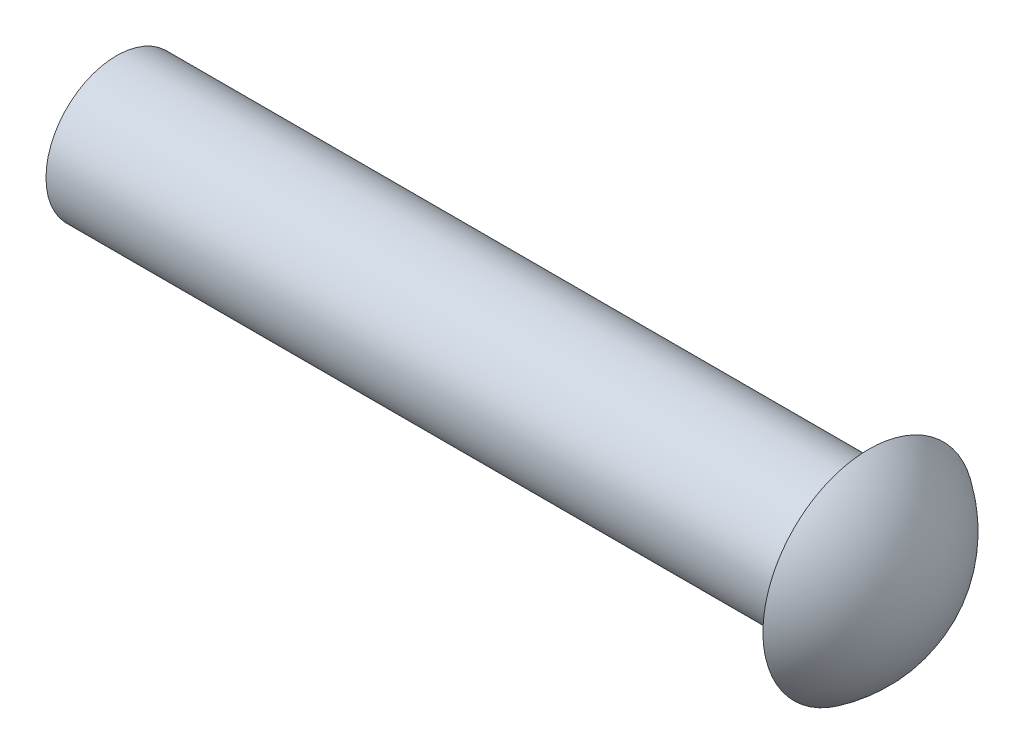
ISO-10303-21;
HEADER;
FILE_DESCRIPTION(('STEP AP214'),'2;1');
FILE_NAME('part.step','',(''),(''),'','','');
FILE_SCHEMA(('AUTOMOTIVE_DESIGN { 1 0 10303 214 1 1 1 1 }'));
ENDSEC;
DATA;
#1=APPLICATION_CONTEXT('core data for automotive mechanical design processes');
#2=APPLICATION_PROTOCOL_DEFINITION('international standard','automotive_design',2000,#1);
#3=PRODUCT_CONTEXT('',#1,'mechanical');
#4=PRODUCT('Part','Part','',(#3));
#5=PRODUCT_RELATED_PRODUCT_CATEGORY('part','',(#4));
#6=PRODUCT_DEFINITION_FORMATION('','',#4);
#7=PRODUCT_DEFINITION_CONTEXT('part definition',#1,'design');
#8=PRODUCT_DEFINITION('design','',#6,#7);
#9=PRODUCT_DEFINITION_SHAPE('','',#8);
#10=(LENGTH_UNIT() NAMED_UNIT(*) SI_UNIT(.MILLI.,.METRE.));
#11=(NAMED_UNIT(*) PLANE_ANGLE_UNIT() SI_UNIT($,.RADIAN.));
#12=(NAMED_UNIT(*) SI_UNIT($,.STERADIAN.) SOLID_ANGLE_UNIT());
#13=UNCERTAINTY_MEASURE_WITH_UNIT(LENGTH_MEASURE(1.E-05),#10,'distance_accuracy_value','');
#14=(GEOMETRIC_REPRESENTATION_CONTEXT(3) GLOBAL_UNCERTAINTY_ASSIGNED_CONTEXT((#13)) GLOBAL_UNIT_ASSIGNED_CONTEXT((#10,
#11,#12)) REPRESENTATION_CONTEXT('',''));
#15=CARTESIAN_POINT('',(0.,0.,0.));
#16=DIRECTION('',(0.,0.,1.));
#17=DIRECTION('',(1.,0.,0.));
#18=AXIS2_PLACEMENT_3D('',#15,#16,#17);
#19=CARTESIAN_POINT('',(0.254,47.752,8.255));
#20=DIRECTION('',(0.744074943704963,0.581212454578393,0.32946101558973));
#21=DIRECTION('',(-0.636418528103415,0.766665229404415,0.0848285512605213));
#22=AXIS2_PLACEMENT_3D('',#19,#20,#21);
#23=SPHERICAL_SURFACE('',#22,2.1336);
#24=CARTESIAN_POINT('',(1.84155829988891,48.9920748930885,8.95793802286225));
#25=VERTEX_POINT('',#24);
#26=VERTEX_LOOP('',#25);
#27=FACE_BOUND('',#26,.T.);
#28=CARTESIAN_POINT('',(1.4224,47.752,10.0402423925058));
#29=CARTESIAN_POINT('',(1.4224,47.6517221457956,10.0402379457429));
#30=CARTESIAN_POINT('',(1.4224,47.5513715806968,10.0317650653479));
#31=CARTESIAN_POINT('',(1.4224,47.3534341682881,9.99808264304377));
#32=CARTESIAN_POINT('',(1.4224,47.2558507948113,9.97285295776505));
#33=CARTESIAN_POINT('',(1.4224,47.0663440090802,9.90637515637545));
#34=CARTESIAN_POINT('',(1.4224,46.974417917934,9.86513469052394));
#35=CARTESIAN_POINT('',(1.4224,46.7988199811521,9.76781650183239));
#36=CARTESIAN_POINT('',(1.4224,46.7151460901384,9.71174246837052));
#37=CARTESIAN_POINT('',(1.4224,46.5583895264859,9.58633755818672));
#38=CARTESIAN_POINT('',(1.4224,46.4853079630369,9.51700529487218));
#39=CARTESIAN_POINT('',(1.4224,46.3518193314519,9.36705274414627));
#40=CARTESIAN_POINT('',(1.4224,46.2914127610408,9.28643201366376));
#41=CARTESIAN_POINT('',(1.4224,46.1849933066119,9.11619488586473));
#42=CARTESIAN_POINT('',(1.4224,46.1389801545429,9.02657865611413));
#43=CARTESIAN_POINT('',(1.4224,46.0626523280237,8.84089339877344));
#44=CARTESIAN_POINT('',(1.4224,46.0323376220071,8.74482438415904));
#45=CARTESIAN_POINT('',(1.4224,45.9882670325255,8.54896032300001));
#46=CARTESIAN_POINT('',(1.4224,45.9745111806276,8.44916526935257));
#47=CARTESIAN_POINT('',(1.4224,45.9639489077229,8.24868237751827));
#48=CARTESIAN_POINT('',(1.4224,45.9671424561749,8.14799454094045));
#49=CARTESIAN_POINT('',(1.4224,45.990388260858,7.9485840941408));
#50=CARTESIAN_POINT('',(1.4224,46.0104405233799,7.84986148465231));
#51=CARTESIAN_POINT('',(1.4224,46.0668345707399,7.65718387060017));
#52=CARTESIAN_POINT('',(1.42239999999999,46.1031763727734,7.56322887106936));
#53=CARTESIAN_POINT('',(1.42239999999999,46.1911178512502,7.38275372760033));
#54=CARTESIAN_POINT('',(1.4224,46.2427175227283,7.29623358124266));
#55=CARTESIAN_POINT('',(1.4224,46.3597099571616,7.13308419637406));
#56=CARTESIAN_POINT('',(1.42240000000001,46.4251027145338,7.05645495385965));
#57=CARTESIAN_POINT('',(1.4224,46.5678250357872,6.9152626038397));
#58=CARTESIAN_POINT('',(1.4224,46.6451546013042,6.85069949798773));
#59=CARTESIAN_POINT('',(1.4224,46.8095553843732,6.73547218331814));
#60=CARTESIAN_POINT('',(1.4224,46.8966266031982,6.68480797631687));
#61=CARTESIAN_POINT('',(1.4224,47.0780389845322,6.59881668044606));
#62=CARTESIAN_POINT('',(1.4224,47.1723801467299,6.56348959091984));
#63=CARTESIAN_POINT('',(1.4224,47.3656543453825,6.50917536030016));
#64=CARTESIAN_POINT('',(1.42240000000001,47.4645873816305,6.49018821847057));
#65=CARTESIAN_POINT('',(1.42240000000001,47.6642369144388,6.46909286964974));
#66=CARTESIAN_POINT('',(1.4224,47.7649534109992,6.46698466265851));
#67=CARTESIAN_POINT('',(1.4224,47.9653108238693,6.47970702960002));
#68=CARTESIAN_POINT('',(1.4224,48.0649517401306,6.49453760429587));
#69=CARTESIAN_POINT('',(1.42240000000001,48.2603294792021,6.54071654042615));
#70=CARTESIAN_POINT('',(1.4224,48.3560663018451,6.57206490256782));
#71=CARTESIAN_POINT('',(1.4224,48.5409181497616,6.65038952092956));
#72=CARTESIAN_POINT('',(1.42239999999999,48.6300331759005,6.69736577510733));
#73=CARTESIAN_POINT('',(1.4224,48.7991117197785,6.80561265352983));
#74=CARTESIAN_POINT('',(1.4224,48.8790752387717,6.86688327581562));
#75=CARTESIAN_POINT('',(1.4224,49.0275808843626,7.00197962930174));
#76=CARTESIAN_POINT('',(1.4224,49.0961230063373,7.07580536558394));
#77=CARTESIAN_POINT('',(1.4224,49.2198401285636,7.23391625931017));
#78=CARTESIAN_POINT('',(1.4224,49.2750151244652,7.31820142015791));
#79=CARTESIAN_POINT('',(1.4224,49.3704316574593,7.49483843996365));
#80=CARTESIAN_POINT('',(1.4224,49.4106732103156,7.58719029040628));
#81=CARTESIAN_POINT('',(1.4224,49.4750805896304,7.77733913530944));
#82=CARTESIAN_POINT('',(1.4224,49.4992464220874,7.87513612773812));
#83=CARTESIAN_POINT('',(1.4224,49.530816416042,8.07339930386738));
#84=CARTESIAN_POINT('',(1.4224,49.5382205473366,8.17386549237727));
#85=CARTESIAN_POINT('',(1.4224,49.5360568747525,8.37461475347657));
#86=CARTESIAN_POINT('',(1.4224,49.5264891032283,8.4748978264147));
#87=CARTESIAN_POINT('',(1.4224,49.4906532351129,8.67243451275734));
#88=CARTESIAN_POINT('',(1.4224,49.4643851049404,8.76968812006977));
#89=CARTESIAN_POINT('',(1.4224,49.3958935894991,8.95840667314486));
#90=CARTESIAN_POINT('',(1.4224,49.3536699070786,9.04987151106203));
#91=CARTESIAN_POINT('',(1.4224,49.2544676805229,9.2244106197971));
#92=CARTESIAN_POINT('',(1.4224,49.1974897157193,9.30748521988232));
#93=CARTESIAN_POINT('',(1.4224,49.0704031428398,9.46288153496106));
#94=CARTESIAN_POINT('',(1.4224,49.0002959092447,9.53520437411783));
#95=CARTESIAN_POINT('',(1.4224,48.8489141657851,9.66707185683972));
#96=CARTESIAN_POINT('',(1.4224,48.7676368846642,9.72661331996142));
#97=CARTESIAN_POINT('',(1.4224,48.5962080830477,9.83122826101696));
#98=CARTESIAN_POINT('',(1.4224,48.5060523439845,9.87629481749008));
#99=CARTESIAN_POINT('',(1.4224,48.3195251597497,9.95060049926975));
#100=CARTESIAN_POINT('',(1.4224,48.2231613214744,9.97985859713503));
#101=CARTESIAN_POINT('',(1.4224,48.0638194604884,10.0139188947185));
#102=CARTESIAN_POINT('',(1.4224,48.0018768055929,10.0237778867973));
#103=CARTESIAN_POINT('',(1.4224,47.8772988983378,10.0369410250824));
#104=CARTESIAN_POINT('',(1.4224,47.8146636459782,10.0402451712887));
#105=CARTESIAN_POINT('',(1.4224,47.752,10.0402423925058));
#106=B_SPLINE_CURVE_WITH_KNOTS('',3,(#28,#29,#30,#31,#32,#33,#34,#35,#36,#37,#38,#39,#40,#41,
#42,#43,#44,#45,#46,#47,#48,#49,#50,#51,#52,#53,#54,#55,#56,#57,#58,#59,#60,#61,#62,#63,#64,#65,
#66,#67,#68,#69,#70,#71,#72,#73,#74,#75,#76,#77,#78,#79,#80,#81,#82,#83,#84,#85,#86,#87,#88,#89,
#90,#91,#92,#93,#94,#95,#96,#97,#98,#99,#100,#101,#102,#103,#104,#105),.UNSPECIFIED.,.T.,.F.,(4,
2,2,2,2,2,2,2,2,2,2,2,2,2,2,2,2,2,2,2,2,2,2,2,2,2,2,2,2,2,2,2,2,2,2,2,2,2,4),(0.,
0.300604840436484,0.601571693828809,0.902394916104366,1.20314338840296,1.50392333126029,
1.80471508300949,2.10550123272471,2.40628677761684,2.70707289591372,3.00785847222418,
3.30864416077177,3.60943016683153,3.9102160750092,4.21100186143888,4.51178768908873,
4.81257355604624,5.11335941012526,5.41414525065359,5.71493109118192,6.01571694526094,
6.31650281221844,6.61728863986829,6.91807442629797,7.21886033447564,7.5196463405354,
7.820432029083,8.12121760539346,8.42200372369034,8.72278926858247,9.02357541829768,
9.32436717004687,9.62514711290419,9.9258955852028,10.2267188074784,10.5276856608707,
10.8282905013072,11.0161385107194,11.2039865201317),.UNSPECIFIED.);
#107=CARTESIAN_POINT('',(1.4224,47.752,10.0402423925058));
#108=VERTEX_POINT('',#107);
#109=EDGE_CURVE('E20',#108,#108,#106,.T.);
#110=ORIENTED_EDGE('',*,*,#109,.T.);
#111=EDGE_LOOP('',(#110));
#112=FACE_BOUND('',#111,.T.);
#113=ADVANCED_FACE('F16',(#27,#112),#23,.T.);
#114=CARTESIAN_POINT('',(1.4224,49.5372423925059,8.255));
#115=DIRECTION('',(1.,0.,0.));
#116=DIRECTION('',(0.,0.,-1.));
#117=AXIS2_PLACEMENT_3D('',#114,#115,#116);
#118=PLANE('',#117);
#119=ORIENTED_EDGE('',*,*,#109,.F.);
#120=EDGE_LOOP('',(#119));
#121=FACE_BOUND('',#120,.T.);
#122=CARTESIAN_POINT('',(1.4224,47.752,8.255));
#123=DIRECTION('',(-1.,0.,0.));
#124=DIRECTION('',(0.,0.,1.));
#125=AXIS2_PLACEMENT_3D('',#122,#123,#124);
#126=CIRCLE('',#125,1.190625);
#127=CARTESIAN_POINT('',(1.4224,47.752,9.445625));
#128=VERTEX_POINT('',#127);
#129=EDGE_CURVE('E28',#128,#128,#126,.T.);
#130=ORIENTED_EDGE('',*,*,#129,.F.);
#131=EDGE_LOOP('',(#130));
#132=FACE_BOUND('',#131,.T.);
#133=ADVANCED_FACE('F34',(#121,#132),#118,.F.);
#134=CARTESIAN_POINT('',(-11.2776,47.752,8.255));
#135=DIRECTION('',(-1.,0.,0.));
#136=DIRECTION('',(0.,0.,1.));
#137=AXIS2_PLACEMENT_3D('',#134,#135,#136);
#138=PLANE('',#137);
#139=CARTESIAN_POINT('',(-11.2776,47.752,8.255));
#140=DIRECTION('',(-1.,0.,0.));
#141=DIRECTION('',(0.,0.,1.));
#142=AXIS2_PLACEMENT_3D('',#139,#140,#141);
#143=CIRCLE('',#142,1.190625);
#144=CARTESIAN_POINT('',(-11.2776,47.752,9.445625));
#145=VERTEX_POINT('',#144);
#146=EDGE_CURVE('E10',#145,#145,#143,.F.);
#147=ORIENTED_EDGE('',*,*,#146,.F.);
#148=EDGE_LOOP('',(#147));
#149=FACE_BOUND('',#148,.T.);
#150=ADVANCED_FACE('F46',(#149),#138,.T.);
#151=CARTESIAN_POINT('',(1.4224,47.752,8.255));
#152=DIRECTION('',(-1.,0.,0.));
#153=DIRECTION('',(0.,0.,1.));
#154=AXIS2_PLACEMENT_3D('',#151,#152,#153);
#155=CYLINDRICAL_SURFACE('',#154,1.190625);
#156=ORIENTED_EDGE('',*,*,#129,.T.);
#157=EDGE_LOOP('',(#156));
#158=FACE_BOUND('',#157,.T.);
#159=ORIENTED_EDGE('',*,*,#146,.T.);
#160=EDGE_LOOP('',(#159));
#161=FACE_BOUND('',#160,.T.);
#162=ADVANCED_FACE('F18',(#158,#161),#155,.T.);
#163=CLOSED_SHELL('',(#113,#133,#150,#162));
#164=MANIFOLD_SOLID_BREP('B1',#163);
#165=ADVANCED_BREP_SHAPE_REPRESENTATION('',(#18,#164),#14);
#166=SHAPE_DEFINITION_REPRESENTATION(#9,#165);
ENDSEC;
END-ISO-10303-21;
